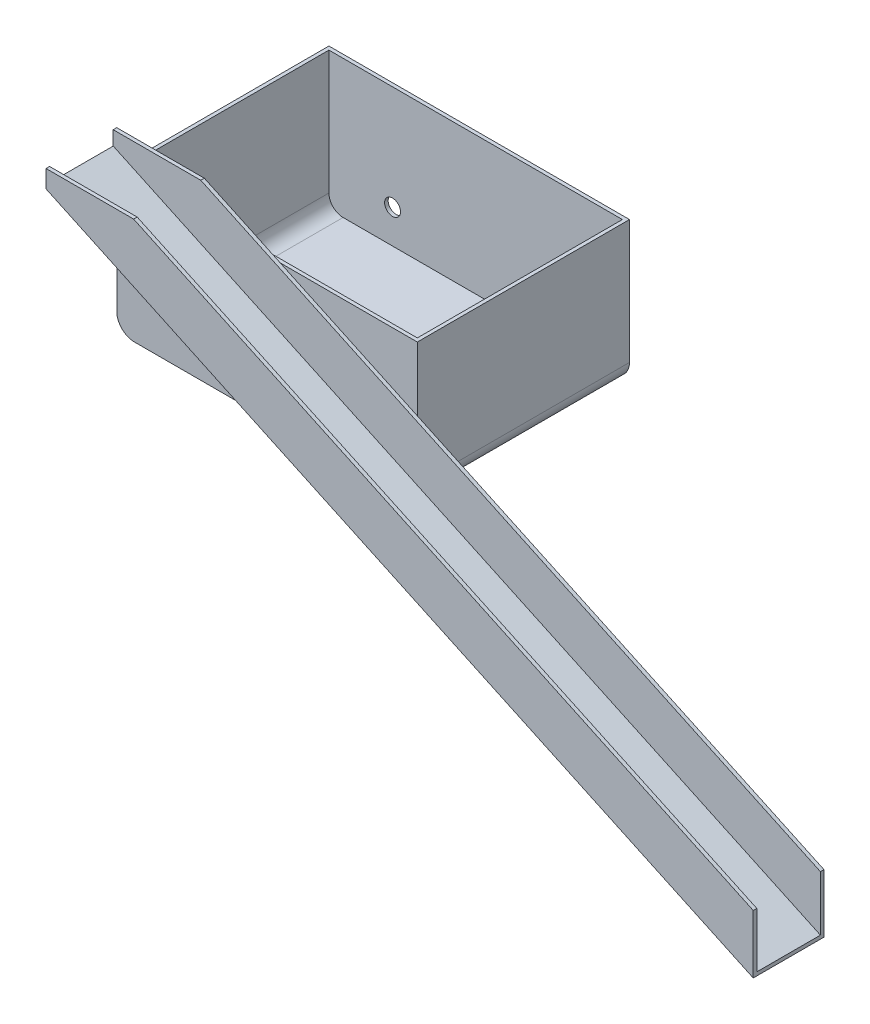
ISO-10303-21;
HEADER;
FILE_DESCRIPTION(('STEP AP214'),'2;1');
FILE_NAME('part.step','',(''),(''),'','','');
FILE_SCHEMA(('AUTOMOTIVE_DESIGN { 1 0 10303 214 1 1 1 1 }'));
ENDSEC;
DATA;
#1=APPLICATION_CONTEXT('core data for automotive mechanical design processes');
#2=APPLICATION_PROTOCOL_DEFINITION('international standard','automotive_design',2000,#1);
#3=PRODUCT_CONTEXT('',#1,'mechanical');
#4=PRODUCT('Part','Part','',(#3));
#5=PRODUCT_RELATED_PRODUCT_CATEGORY('part','',(#4));
#6=PRODUCT_DEFINITION_FORMATION('','',#4);
#7=PRODUCT_DEFINITION_CONTEXT('part definition',#1,'design');
#8=PRODUCT_DEFINITION('design','',#6,#7);
#9=PRODUCT_DEFINITION_SHAPE('','',#8);
#10=(LENGTH_UNIT() NAMED_UNIT(*) SI_UNIT(.MILLI.,.METRE.));
#11=(NAMED_UNIT(*) PLANE_ANGLE_UNIT() SI_UNIT($,.RADIAN.));
#12=(NAMED_UNIT(*) SI_UNIT($,.STERADIAN.) SOLID_ANGLE_UNIT());
#13=UNCERTAINTY_MEASURE_WITH_UNIT(LENGTH_MEASURE(1.E-05),#10,'distance_accuracy_value','');
#14=(GEOMETRIC_REPRESENTATION_CONTEXT(3) GLOBAL_UNCERTAINTY_ASSIGNED_CONTEXT((#13)) GLOBAL_UNIT_ASSIGNED_CONTEXT((#10,
#11,#12)) REPRESENTATION_CONTEXT('',''));
#15=CARTESIAN_POINT('',(0.,0.,0.));
#16=DIRECTION('',(0.,0.,1.));
#17=DIRECTION('',(1.,0.,0.));
#18=AXIS2_PLACEMENT_3D('',#15,#16,#17);
#19=CARTESIAN_POINT('',(24.7704891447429,98.2615316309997,80.));
#20=DIRECTION('',(-0.422618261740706,-0.906307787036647,0.));
#21=DIRECTION('',(0.906307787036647,-0.422618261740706,0.));
#22=AXIS2_PLACEMENT_3D('',#19,#20,#21);
#23=PLANE('',#22);
#24=DIRECTION('',(0.,0.,-1.));
#25=VECTOR('',#24,1.);
#26=CARTESIAN_POINT('',(200.,16.5506687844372,80.));
#27=LINE('',#26,#25);
#28=CARTESIAN_POINT('',(200.,16.5506687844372,80.));
#29=VERTEX_POINT('',#28);
#30=CARTESIAN_POINT('',(200.,16.5506687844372,79.));
#31=VERTEX_POINT('',#30);
#32=EDGE_CURVE('E267',#29,#31,#27,.T.);
#33=ORIENTED_EDGE('',*,*,#32,.T.);
#34=DIRECTION('',(-0.906307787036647,0.422618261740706,0.));
#35=VECTOR('',#34,1.);
#36=CARTESIAN_POINT('',(24.7704891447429,98.2615316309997,79.));
#37=LINE('',#36,#35);
#38=CARTESIAN_POINT('',(24.7704891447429,98.2615316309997,79.));
#39=VERTEX_POINT('',#38);
#40=EDGE_CURVE('E199',#31,#39,#37,.T.);
#41=ORIENTED_EDGE('',*,*,#40,.T.);
#42=DIRECTION('',(0.,0.,-1.));
#43=VECTOR('',#42,1.);
#44=CARTESIAN_POINT('',(24.7704891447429,98.2615316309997,80.));
#45=LINE('',#44,#43);
#46=CARTESIAN_POINT('',(24.7704891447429,98.2615316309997,80.));
#47=VERTEX_POINT('',#46);
#48=EDGE_CURVE('E263',#47,#39,#45,.T.);
#49=ORIENTED_EDGE('',*,*,#48,.F.);
#50=DIRECTION('',(-0.906307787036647,0.422618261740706,0.));
#51=VECTOR('',#50,1.);
#52=CARTESIAN_POINT('',(24.7704891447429,98.2615316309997,80.));
#53=LINE('',#52,#51);
#54=EDGE_CURVE('E238',#29,#47,#53,.T.);
#55=ORIENTED_EDGE('',*,*,#54,.F.);
#56=EDGE_LOOP('',(#33,#41,#49,#55));
#57=FACE_BOUND('',#56,.T.);
#58=ADVANCED_FACE('F32',(#57),#23,.F.);
#59=CARTESIAN_POINT('',(0.,98.2615316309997,80.));
#60=DIRECTION('',(0.,-1.,0.));
#61=DIRECTION('',(0.,0.,-1.));
#62=AXIS2_PLACEMENT_3D('',#59,#60,#61);
#63=PLANE('',#62);
#64=ORIENTED_EDGE('',*,*,#48,.T.);
#65=DIRECTION('',(-1.,0.,0.));
#66=VECTOR('',#65,1.);
#67=CARTESIAN_POINT('',(0.,98.2615316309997,79.));
#68=LINE('',#67,#66);
#69=CARTESIAN_POINT('',(0.,98.2615316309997,79.));
#70=VERTEX_POINT('',#69);
#71=EDGE_CURVE('E11',#39,#70,#68,.T.);
#72=ORIENTED_EDGE('',*,*,#71,.T.);
#73=DIRECTION('',(0.,0.,-1.));
#74=VECTOR('',#73,1.);
#75=CARTESIAN_POINT('',(0.,98.2615316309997,80.));
#76=LINE('',#75,#74);
#77=CARTESIAN_POINT('',(0.,98.2615316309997,80.));
#78=VERTEX_POINT('',#77);
#79=EDGE_CURVE('E259',#78,#70,#76,.T.);
#80=ORIENTED_EDGE('',*,*,#79,.F.);
#81=DIRECTION('',(-1.,0.,0.));
#82=VECTOR('',#81,1.);
#83=CARTESIAN_POINT('',(0.,98.2615316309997,80.));
#84=LINE('',#83,#82);
#85=EDGE_CURVE('E240',#47,#78,#84,.T.);
#86=ORIENTED_EDGE('',*,*,#85,.F.);
#87=EDGE_LOOP('',(#64,#72,#80,#86));
#88=FACE_BOUND('',#87,.T.);
#89=ADVANCED_FACE('F446',(#88),#63,.F.);
#90=CARTESIAN_POINT('',(85.,48.2615316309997,60.));
#91=DIRECTION('',(0.,0.,-1.));
#92=DIRECTION('',(-1.,0.,0.));
#93=AXIS2_PLACEMENT_3D('',#90,#91,#92);
#94=PLANE('',#93);
#95=DIRECTION('',(-0.906307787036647,0.422618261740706,0.));
#96=VECTOR('',#95,1.);
#97=CARTESIAN_POINT('',(24.7704891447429,98.2615316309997,60.));
#98=LINE('',#97,#96);
#99=CARTESIAN_POINT('',(85.,70.1760494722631,60.));
#100=VERTEX_POINT('',#99);
#101=CARTESIAN_POINT('',(46.215558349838,88.2615316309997,60.));
#102=VERTEX_POINT('',#101);
#103=EDGE_CURVE('E256',#100,#102,#98,.T.);
#104=ORIENTED_EDGE('',*,*,#103,.F.);
#105=DIRECTION('',(0.,1.,0.));
#106=VECTOR('',#105,1.);
#107=CARTESIAN_POINT('',(85.,53.6253806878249,60.));
#108=LINE('',#107,#106);
#109=CARTESIAN_POINT('',(85.,88.2615316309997,60.));
#110=VERTEX_POINT('',#109);
#111=EDGE_CURVE('E326',#100,#110,#108,.T.);
#112=ORIENTED_EDGE('',*,*,#111,.T.);
#113=DIRECTION('',(-1.,0.,0.));
#114=VECTOR('',#113,1.);
#115=CARTESIAN_POINT('',(0.,88.2615316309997,60.));
#116=LINE('',#115,#114);
#117=EDGE_CURVE('E332',#110,#102,#116,.T.);
#118=ORIENTED_EDGE('',*,*,#117,.T.);
#119=EDGE_LOOP('',(#104,#112,#118));
#120=FACE_BOUND('',#119,.T.);
#121=ADVANCED_FACE('F452',(#120),#94,.F.);
#122=DIRECTION('',(0.90630778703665,-0.422618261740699,0.));
#123=VECTOR('',#122,1.);
#124=CARTESIAN_POINT('',(0.,93.2615316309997,60.));
#125=LINE('',#124,#123);
#126=CARTESIAN_POINT('',(10.7225346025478,88.2615316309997,60.));
#127=VERTEX_POINT('',#126);
#128=CARTESIAN_POINT('',(85.,53.6253806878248,60.));
#129=VERTEX_POINT('',#128);
#130=EDGE_CURVE('E55',#127,#129,#125,.T.);
#131=ORIENTED_EDGE('',*,*,#130,.F.);
#132=CARTESIAN_POINT('',(0.,88.2615316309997,60.));
#133=VERTEX_POINT('',#132);
#134=EDGE_CURVE('E330',#127,#133,#116,.T.);
#135=ORIENTED_EDGE('',*,*,#134,.T.);
#136=DIRECTION('',(0.,-1.,0.));
#137=VECTOR('',#136,1.);
#138=CARTESIAN_POINT('',(0.,88.2615316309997,60.));
#139=LINE('',#138,#137);
#140=CARTESIAN_POINT('',(0.,53.2615316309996,60.));
#141=VERTEX_POINT('',#140);
#142=EDGE_CURVE('E335',#133,#141,#139,.T.);
#143=ORIENTED_EDGE('',*,*,#142,.T.);
#144=CARTESIAN_POINT('',(5.,53.2615316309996,60.));
#145=DIRECTION('',(0.,0.,-1.));
#146=DIRECTION('',(-1.,0.,0.));
#147=AXIS2_PLACEMENT_3D('',#144,#145,#146);
#148=CIRCLE('',#147,5.);
#149=CARTESIAN_POINT('',(5.,48.2615316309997,60.));
#150=VERTEX_POINT('',#149);
#151=EDGE_CURVE('E366',#141,#150,#148,.F.);
#152=ORIENTED_EDGE('',*,*,#151,.T.);
#153=DIRECTION('',(1.,0.,0.));
#154=VECTOR('',#153,1.);
#155=CARTESIAN_POINT('',(0.,48.2615316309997,60.));
#156=LINE('',#155,#154);
#157=CARTESIAN_POINT('',(80.,48.2615316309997,60.));
#158=VERTEX_POINT('',#157);
#159=EDGE_CURVE('E323',#150,#158,#156,.T.);
#160=ORIENTED_EDGE('',*,*,#159,.T.);
#161=CARTESIAN_POINT('',(80.,53.2615316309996,60.));
#162=DIRECTION('',(0.,0.,-1.));
#163=DIRECTION('',(-1.,0.,0.));
#164=AXIS2_PLACEMENT_3D('',#161,#162,#163);
#165=CIRCLE('',#164,5.);
#166=CARTESIAN_POINT('',(85.,53.2615316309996,60.));
#167=VERTEX_POINT('',#166);
#168=EDGE_CURVE('E368',#158,#167,#165,.F.);
#169=ORIENTED_EDGE('',*,*,#168,.T.);
#170=EDGE_CURVE('E328',#167,#129,#108,.T.);
#171=ORIENTED_EDGE('',*,*,#170,.T.);
#172=EDGE_LOOP('',(#131,#135,#143,#152,#160,#169,#171));
#173=FACE_BOUND('',#172,.T.);
#174=ADVANCED_FACE('F544',(#173),#94,.F.);
#175=CARTESIAN_POINT('',(0.,88.2615316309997,60.));
#176=DIRECTION('',(0.,-1.,0.));
#177=DIRECTION('',(0.,0.,-1.));
#178=AXIS2_PLACEMENT_3D('',#175,#176,#177);
#179=PLANE('',#178);
#180=DIRECTION('',(-1.,0.,0.));
#181=VECTOR('',#180,1.);
#182=CARTESIAN_POINT('',(0.,88.2615316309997,0.));
#183=LINE('',#182,#181);
#184=CARTESIAN_POINT('',(85.,88.2615316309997,0.));
#185=VERTEX_POINT('',#184);
#186=CARTESIAN_POINT('',(0.,88.2615316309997,0.));
#187=VERTEX_POINT('',#186);
#188=EDGE_CURVE('E344',#185,#187,#183,.T.);
#189=ORIENTED_EDGE('',*,*,#188,.T.);
#190=DIRECTION('',(0.,0.,-1.));
#191=VECTOR('',#190,1.);
#192=CARTESIAN_POINT('',(0.,88.2615316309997,60.));
#193=LINE('',#192,#191);
#194=EDGE_CURVE('E339',#133,#187,#193,.T.);
#195=ORIENTED_EDGE('',*,*,#194,.F.);
#196=ORIENTED_EDGE('',*,*,#134,.F.);
#197=EDGE_CURVE('E336',#102,#127,#116,.T.);
#198=ORIENTED_EDGE('',*,*,#197,.F.);
#199=ORIENTED_EDGE('',*,*,#117,.F.);
#200=DIRECTION('',(0.,0.,-1.));
#201=VECTOR('',#200,1.);
#202=CARTESIAN_POINT('',(85.,88.2615316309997,60.));
#203=LINE('',#202,#201);
#204=EDGE_CURVE('E351',#110,#185,#203,.T.);
#205=ORIENTED_EDGE('',*,*,#204,.T.);
#206=EDGE_LOOP('',(#189,#195,#196,#198,#199,#205));
#207=FACE_BOUND('',#206,.T.);
#208=DIRECTION('',(-1.,0.,0.));
#209=VECTOR('',#208,1.);
#210=CARTESIAN_POINT('',(85.,88.2615316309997,1.));
#211=LINE('',#210,#209);
#212=CARTESIAN_POINT('',(84.,88.2615316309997,1.));
#213=VERTEX_POINT('',#212);
#214=CARTESIAN_POINT('',(1.,88.2615316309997,1.));
#215=VERTEX_POINT('',#214);
#216=EDGE_CURVE('E308',#213,#215,#211,.T.);
#217=ORIENTED_EDGE('',*,*,#216,.F.);
#218=DIRECTION('',(0.,0.,-1.));
#219=VECTOR('',#218,1.);
#220=CARTESIAN_POINT('',(84.,88.2615316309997,60.));
#221=LINE('',#220,#219);
#222=CARTESIAN_POINT('',(84.,88.2615316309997,59.));
#223=VERTEX_POINT('',#222);
#224=EDGE_CURVE('E306',#223,#213,#221,.T.);
#225=ORIENTED_EDGE('',*,*,#224,.F.);
#226=DIRECTION('',(-1.,0.,0.));
#227=VECTOR('',#226,1.);
#228=CARTESIAN_POINT('',(85.,88.2615316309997,59.));
#229=LINE('',#228,#227);
#230=CARTESIAN_POINT('',(1.,88.2615316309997,59.));
#231=VERTEX_POINT('',#230);
#232=EDGE_CURVE('E296',#223,#231,#229,.T.);
#233=ORIENTED_EDGE('',*,*,#232,.T.);
#234=DIRECTION('',(0.,0.,-1.));
#235=VECTOR('',#234,1.);
#236=CARTESIAN_POINT('',(1.,88.2615316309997,60.));
#237=LINE('',#236,#235);
#238=EDGE_CURVE('E300',#231,#215,#237,.T.);
#239=ORIENTED_EDGE('',*,*,#238,.T.);
#240=EDGE_LOOP('',(#217,#225,#233,#239));
#241=FACE_BOUND('',#240,.T.);
#242=ADVANCED_FACE('F421',(#207,#241),#179,.F.);
#243=CARTESIAN_POINT('',(85.,48.2615316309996,60.));
#244=DIRECTION('',(0.,1.,0.));
#245=DIRECTION('',(0.,0.,1.));
#246=AXIS2_PLACEMENT_3D('',#243,#244,#245);
#247=PLANE('',#246);
#248=DIRECTION('',(1.,0.,0.));
#249=VECTOR('',#248,1.);
#250=CARTESIAN_POINT('',(85.,48.2615316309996,0.));
#251=LINE('',#250,#249);
#252=CARTESIAN_POINT('',(5.,48.2615316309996,0.));
#253=VERTEX_POINT('',#252);
#254=CARTESIAN_POINT('',(80.,48.2615316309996,0.));
#255=VERTEX_POINT('',#254);
#256=EDGE_CURVE('E314',#253,#255,#251,.T.);
#257=ORIENTED_EDGE('',*,*,#256,.T.);
#258=DIRECTION('',(0.,0.,-1.));
#259=VECTOR('',#258,1.);
#260=CARTESIAN_POINT('',(80.,48.2615316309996,60.));
#261=LINE('',#260,#259);
#262=EDGE_CURVE('E364',#255,#158,#261,.F.);
#263=ORIENTED_EDGE('',*,*,#262,.T.);
#264=ORIENTED_EDGE('',*,*,#159,.F.);
#265=DIRECTION('',(0.,0.,-1.));
#266=VECTOR('',#265,1.);
#267=CARTESIAN_POINT('',(5.,48.2615316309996,60.));
#268=LINE('',#267,#266);
#269=EDGE_CURVE('E361',#150,#253,#268,.T.);
#270=ORIENTED_EDGE('',*,*,#269,.T.);
#271=EDGE_LOOP('',(#257,#263,#264,#270));
#272=FACE_BOUND('',#271,.T.);
#273=ADVANCED_FACE('F556',(#272),#247,.F.);
#274=CARTESIAN_POINT('',(85.,88.2615316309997,60.));
#275=DIRECTION('',(-1.,0.,0.));
#276=DIRECTION('',(0.,0.,1.));
#277=AXIS2_PLACEMENT_3D('',#274,#275,#276);
#278=PLANE('',#277);
#279=ORIENTED_EDGE('',*,*,#170,.F.);
#280=DIRECTION('',(0.,0.,-1.));
#281=VECTOR('',#280,1.);
#282=CARTESIAN_POINT('',(85.,53.2615316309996,60.));
#283=LINE('',#282,#281);
#284=CARTESIAN_POINT('',(85.,53.2615316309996,0.));
#285=VERTEX_POINT('',#284);
#286=EDGE_CURVE('E354',#167,#285,#283,.T.);
#287=ORIENTED_EDGE('',*,*,#286,.T.);
#288=DIRECTION('',(0.,1.,0.));
#289=VECTOR('',#288,1.);
#290=CARTESIAN_POINT('',(85.,88.2615316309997,0.));
#291=LINE('',#290,#289);
#292=EDGE_CURVE('E342',#285,#185,#291,.T.);
#293=ORIENTED_EDGE('',*,*,#292,.T.);
#294=ORIENTED_EDGE('',*,*,#204,.F.);
#295=ORIENTED_EDGE('',*,*,#111,.F.);
#296=EDGE_CURVE('E331',#129,#100,#108,.T.);
#297=ORIENTED_EDGE('',*,*,#296,.F.);
#298=EDGE_LOOP('',(#279,#287,#293,#294,#295,#297));
#299=FACE_BOUND('',#298,.T.);
#300=ADVANCED_FACE('F564',(#299),#278,.F.);
#301=CARTESIAN_POINT('',(0.,53.2615316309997,60.));
#302=DIRECTION('',(1.,0.,0.));
#303=DIRECTION('',(0.,0.,-1.));
#304=AXIS2_PLACEMENT_3D('',#301,#302,#303);
#305=PLANE('',#304);
#306=DIRECTION('',(0.,-1.,0.));
#307=VECTOR('',#306,1.);
#308=CARTESIAN_POINT('',(0.,53.2615316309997,0.));
#309=LINE('',#308,#307);
#310=CARTESIAN_POINT('',(0.,53.2615316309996,0.));
#311=VERTEX_POINT('',#310);
#312=EDGE_CURVE('E327',#187,#311,#309,.T.);
#313=ORIENTED_EDGE('',*,*,#312,.T.);
#314=DIRECTION('',(0.,0.,-1.));
#315=VECTOR('',#314,1.);
#316=CARTESIAN_POINT('',(0.,53.2615316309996,60.));
#317=LINE('',#316,#315);
#318=EDGE_CURVE('E370',#311,#141,#317,.F.);
#319=ORIENTED_EDGE('',*,*,#318,.T.);
#320=ORIENTED_EDGE('',*,*,#142,.F.);
#321=ORIENTED_EDGE('',*,*,#194,.T.);
#322=EDGE_LOOP('',(#313,#319,#320,#321));
#323=FACE_BOUND('',#322,.T.);
#324=ADVANCED_FACE('F549',(#323),#305,.F.);
#325=CARTESIAN_POINT('',(85.,48.2615316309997,0.));
#326=DIRECTION('',(0.,0.,-1.));
#327=DIRECTION('',(-1.,0.,0.));
#328=AXIS2_PLACEMENT_3D('',#325,#326,#327);
#329=PLANE('',#328);
#330=CARTESIAN_POINT('',(66.,58.7615316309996,0.));
#331=DIRECTION('',(0.,0.,-1.));
#332=DIRECTION('',(-1.,0.,0.));
#333=AXIS2_PLACEMENT_3D('',#330,#331,#332);
#334=CIRCLE('',#333,2.25);
#335=CARTESIAN_POINT('',(63.75,58.7615316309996,0.));
#336=VERTEX_POINT('',#335);
#337=EDGE_CURVE('E396',#336,#336,#334,.T.);
#338=ORIENTED_EDGE('',*,*,#337,.F.);
#339=EDGE_LOOP('',(#338));
#340=FACE_BOUND('',#339,.T.);
#341=CARTESIAN_POINT('',(19.,58.7615316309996,0.));
#342=DIRECTION('',(0.,0.,-1.));
#343=DIRECTION('',(-1.,0.,0.));
#344=AXIS2_PLACEMENT_3D('',#341,#342,#343);
#345=CIRCLE('',#344,2.25);
#346=CARTESIAN_POINT('',(16.75,58.7615316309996,0.));
#347=VERTEX_POINT('',#346);
#348=EDGE_CURVE('E205',#347,#347,#345,.T.);
#349=ORIENTED_EDGE('',*,*,#348,.F.);
#350=EDGE_LOOP('',(#349));
#351=FACE_BOUND('',#350,.T.);
#352=ORIENTED_EDGE('',*,*,#292,.F.);
#353=CARTESIAN_POINT('',(80.,53.2615316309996,0.));
#354=DIRECTION('',(0.,0.,-1.));
#355=DIRECTION('',(-1.,0.,0.));
#356=AXIS2_PLACEMENT_3D('',#353,#354,#355);
#357=CIRCLE('',#356,5.);
#358=EDGE_CURVE('E359',#285,#255,#357,.T.);
#359=ORIENTED_EDGE('',*,*,#358,.T.);
#360=ORIENTED_EDGE('',*,*,#256,.F.);
#361=CARTESIAN_POINT('',(5.,53.2615316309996,0.));
#362=DIRECTION('',(0.,0.,-1.));
#363=DIRECTION('',(-1.,0.,0.));
#364=AXIS2_PLACEMENT_3D('',#361,#362,#363);
#365=CIRCLE('',#364,5.);
#366=EDGE_CURVE('E357',#253,#311,#365,.T.);
#367=ORIENTED_EDGE('',*,*,#366,.T.);
#368=ORIENTED_EDGE('',*,*,#312,.F.);
#369=ORIENTED_EDGE('',*,*,#188,.F.);
#370=EDGE_LOOP('',(#352,#359,#360,#367,#368,#369));
#371=FACE_BOUND('',#370,.T.);
#372=ADVANCED_FACE('F493',(#340,#351,#371),#329,.T.);
#373=CARTESIAN_POINT('',(80.,53.2615316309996,60.));
#374=DIRECTION('',(0.,0.,-1.));
#375=DIRECTION('',(-1.,0.,0.));
#376=AXIS2_PLACEMENT_3D('',#373,#374,#375);
#377=CYLINDRICAL_SURFACE('',#376,5.);
#378=ORIENTED_EDGE('',*,*,#168,.F.);
#379=ORIENTED_EDGE('',*,*,#262,.F.);
#380=ORIENTED_EDGE('',*,*,#358,.F.);
#381=ORIENTED_EDGE('',*,*,#286,.F.);
#382=EDGE_LOOP('',(#378,#379,#380,#381));
#383=FACE_BOUND('',#382,.T.);
#384=ADVANCED_FACE('F560',(#383),#377,.T.);
#385=CARTESIAN_POINT('',(5.,53.2615316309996,60.));
#386=DIRECTION('',(0.,0.,-1.));
#387=DIRECTION('',(-1.,0.,0.));
#388=AXIS2_PLACEMENT_3D('',#385,#386,#387);
#389=CYLINDRICAL_SURFACE('',#388,5.);
#390=ORIENTED_EDGE('',*,*,#151,.F.);
#391=ORIENTED_EDGE('',*,*,#318,.F.);
#392=ORIENTED_EDGE('',*,*,#366,.F.);
#393=ORIENTED_EDGE('',*,*,#269,.F.);
#394=EDGE_LOOP('',(#390,#391,#392,#393));
#395=FACE_BOUND('',#394,.T.);
#396=ADVANCED_FACE('F34',(#395),#389,.T.);
#397=CARTESIAN_POINT('',(85.,49.2615316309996,60.));
#398=DIRECTION('',(0.,1.,0.));
#399=DIRECTION('',(0.,0.,1.));
#400=AXIS2_PLACEMENT_3D('',#397,#398,#399);
#401=PLANE('',#400);
#402=DIRECTION('',(1.,0.,0.));
#403=VECTOR('',#402,1.);
#404=CARTESIAN_POINT('',(85.,49.2615316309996,1.));
#405=LINE('',#404,#403);
#406=CARTESIAN_POINT('',(5.,49.2615316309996,1.));
#407=VERTEX_POINT('',#406);
#408=CARTESIAN_POINT('',(80.,49.2615316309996,1.));
#409=VERTEX_POINT('',#408);
#410=EDGE_CURVE('E275',#407,#409,#405,.T.);
#411=ORIENTED_EDGE('',*,*,#410,.F.);
#412=DIRECTION('',(0.,0.,1.));
#413=VECTOR('',#412,1.);
#414=CARTESIAN_POINT('',(5.,49.2615316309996,60.));
#415=LINE('',#414,#413);
#416=CARTESIAN_POINT('',(5.,49.2615316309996,59.));
#417=VERTEX_POINT('',#416);
#418=EDGE_CURVE('E282',#417,#407,#415,.F.);
#419=ORIENTED_EDGE('',*,*,#418,.F.);
#420=DIRECTION('',(1.,0.,0.));
#421=VECTOR('',#420,1.);
#422=CARTESIAN_POINT('',(85.,49.2615316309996,59.));
#423=LINE('',#422,#421);
#424=CARTESIAN_POINT('',(80.,49.2615316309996,59.));
#425=VERTEX_POINT('',#424);
#426=EDGE_CURVE('E283',#417,#425,#423,.T.);
#427=ORIENTED_EDGE('',*,*,#426,.T.);
#428=DIRECTION('',(0.,0.,1.));
#429=VECTOR('',#428,1.);
#430=CARTESIAN_POINT('',(80.,49.2615316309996,60.));
#431=LINE('',#430,#429);
#432=EDGE_CURVE('E279',#409,#425,#431,.T.);
#433=ORIENTED_EDGE('',*,*,#432,.F.);
#434=EDGE_LOOP('',(#411,#419,#427,#433));
#435=FACE_BOUND('',#434,.T.);
#436=ADVANCED_FACE('F436',(#435),#401,.T.);
#437=CARTESIAN_POINT('',(84.,88.2615316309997,60.));
#438=DIRECTION('',(-1.,0.,0.));
#439=DIRECTION('',(0.,0.,1.));
#440=AXIS2_PLACEMENT_3D('',#437,#438,#439);
#441=PLANE('',#440);
#442=DIRECTION('',(0.,1.,0.));
#443=VECTOR('',#442,1.);
#444=CARTESIAN_POINT('',(84.,48.2615316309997,59.));
#445=LINE('',#444,#443);
#446=CARTESIAN_POINT('',(84.,53.2615316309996,59.));
#447=VERTEX_POINT('',#446);
#448=EDGE_CURVE('E286',#447,#223,#445,.T.);
#449=ORIENTED_EDGE('',*,*,#448,.T.);
#450=ORIENTED_EDGE('',*,*,#224,.T.);
#451=DIRECTION('',(0.,1.,0.));
#452=VECTOR('',#451,1.);
#453=CARTESIAN_POINT('',(84.,48.2615316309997,1.));
#454=LINE('',#453,#452);
#455=CARTESIAN_POINT('',(84.,53.2615316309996,1.));
#456=VERTEX_POINT('',#455);
#457=EDGE_CURVE('E278',#456,#213,#454,.T.);
#458=ORIENTED_EDGE('',*,*,#457,.F.);
#459=DIRECTION('',(0.,0.,1.));
#460=VECTOR('',#459,1.);
#461=CARTESIAN_POINT('',(84.,53.2615316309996,60.));
#462=LINE('',#461,#460);
#463=EDGE_CURVE('E302',#447,#456,#462,.F.);
#464=ORIENTED_EDGE('',*,*,#463,.F.);
#465=EDGE_LOOP('',(#449,#450,#458,#464));
#466=FACE_BOUND('',#465,.T.);
#467=ADVANCED_FACE('F418',(#466),#441,.T.);
#468=CARTESIAN_POINT('',(1.,53.2615316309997,60.));
#469=DIRECTION('',(1.,0.,0.));
#470=DIRECTION('',(0.,0.,-1.));
#471=AXIS2_PLACEMENT_3D('',#468,#469,#470);
#472=PLANE('',#471);
#473=DIRECTION('',(0.,-1.,0.));
#474=VECTOR('',#473,1.);
#475=CARTESIAN_POINT('',(1.,48.2615316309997,1.));
#476=LINE('',#475,#474);
#477=CARTESIAN_POINT('',(1.,53.2615316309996,1.));
#478=VERTEX_POINT('',#477);
#479=EDGE_CURVE('E287',#215,#478,#476,.T.);
#480=ORIENTED_EDGE('',*,*,#479,.F.);
#481=ORIENTED_EDGE('',*,*,#238,.F.);
#482=DIRECTION('',(0.,-1.,0.));
#483=VECTOR('',#482,1.);
#484=CARTESIAN_POINT('',(1.,48.2615316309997,59.));
#485=LINE('',#484,#483);
#486=CARTESIAN_POINT('',(1.,53.2615316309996,59.));
#487=VERTEX_POINT('',#486);
#488=EDGE_CURVE('E297',#231,#487,#485,.T.);
#489=ORIENTED_EDGE('',*,*,#488,.T.);
#490=DIRECTION('',(0.,0.,-1.));
#491=VECTOR('',#490,1.);
#492=CARTESIAN_POINT('',(1.,53.2615316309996,60.));
#493=LINE('',#492,#491);
#494=EDGE_CURVE('E293',#478,#487,#493,.F.);
#495=ORIENTED_EDGE('',*,*,#494,.F.);
#496=EDGE_LOOP('',(#480,#481,#489,#495));
#497=FACE_BOUND('',#496,.T.);
#498=ADVANCED_FACE('F424',(#497),#472,.T.);
#499=CARTESIAN_POINT('',(85.,48.2615316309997,59.));
#500=DIRECTION('',(0.,0.,-1.));
#501=DIRECTION('',(-1.,0.,0.));
#502=AXIS2_PLACEMENT_3D('',#499,#500,#501);
#503=PLANE('',#502);
#504=ORIENTED_EDGE('',*,*,#426,.F.);
#505=CARTESIAN_POINT('',(5.,53.2615316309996,59.));
#506=DIRECTION('',(0.,0.,-1.));
#507=DIRECTION('',(-1.,0.,0.));
#508=AXIS2_PLACEMENT_3D('',#505,#506,#507);
#509=CIRCLE('',#508,4.);
#510=EDGE_CURVE('E281',#487,#417,#509,.F.);
#511=ORIENTED_EDGE('',*,*,#510,.F.);
#512=ORIENTED_EDGE('',*,*,#488,.F.);
#513=ORIENTED_EDGE('',*,*,#232,.F.);
#514=ORIENTED_EDGE('',*,*,#448,.F.);
#515=CARTESIAN_POINT('',(80.,53.2615316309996,59.));
#516=DIRECTION('',(0.,0.,-1.));
#517=DIRECTION('',(-1.,0.,0.));
#518=AXIS2_PLACEMENT_3D('',#515,#516,#517);
#519=CIRCLE('',#518,4.);
#520=EDGE_CURVE('E291',#425,#447,#519,.F.);
#521=ORIENTED_EDGE('',*,*,#520,.F.);
#522=EDGE_LOOP('',(#504,#511,#512,#513,#514,#521));
#523=FACE_BOUND('',#522,.T.);
#524=ADVANCED_FACE('F409',(#523),#503,.T.);
#525=CARTESIAN_POINT('',(85.,48.2615316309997,1.));
#526=DIRECTION('',(0.,0.,-1.));
#527=DIRECTION('',(-1.,0.,0.));
#528=AXIS2_PLACEMENT_3D('',#525,#526,#527);
#529=PLANE('',#528);
#530=CARTESIAN_POINT('',(66.,58.7615316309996,1.));
#531=DIRECTION('',(0.,0.,1.));
#532=DIRECTION('',(1.,0.,0.));
#533=AXIS2_PLACEMENT_3D('',#530,#531,#532);
#534=CIRCLE('',#533,2.25);
#535=CARTESIAN_POINT('',(68.25,58.7615316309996,1.));
#536=VERTEX_POINT('',#535);
#537=EDGE_CURVE('E399',#536,#536,#534,.T.);
#538=ORIENTED_EDGE('',*,*,#537,.F.);
#539=EDGE_LOOP('',(#538));
#540=FACE_BOUND('',#539,.T.);
#541=CARTESIAN_POINT('',(19.,58.7615316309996,1.));
#542=DIRECTION('',(0.,0.,1.));
#543=DIRECTION('',(1.,0.,0.));
#544=AXIS2_PLACEMENT_3D('',#541,#542,#543);
#545=CIRCLE('',#544,2.25);
#546=CARTESIAN_POINT('',(21.25,58.7615316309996,1.));
#547=VERTEX_POINT('',#546);
#548=EDGE_CURVE('E393',#547,#547,#545,.T.);
#549=ORIENTED_EDGE('',*,*,#548,.F.);
#550=EDGE_LOOP('',(#549));
#551=FACE_BOUND('',#550,.T.);
#552=ORIENTED_EDGE('',*,*,#457,.T.);
#553=ORIENTED_EDGE('',*,*,#216,.T.);
#554=ORIENTED_EDGE('',*,*,#479,.T.);
#555=CARTESIAN_POINT('',(5.,53.2615316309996,1.));
#556=DIRECTION('',(0.,0.,-1.));
#557=DIRECTION('',(-1.,0.,0.));
#558=AXIS2_PLACEMENT_3D('',#555,#556,#557);
#559=CIRCLE('',#558,4.);
#560=EDGE_CURVE('E305',#407,#478,#559,.T.);
#561=ORIENTED_EDGE('',*,*,#560,.F.);
#562=ORIENTED_EDGE('',*,*,#410,.T.);
#563=CARTESIAN_POINT('',(80.,53.2615316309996,1.));
#564=DIRECTION('',(0.,0.,-1.));
#565=DIRECTION('',(-1.,0.,0.));
#566=AXIS2_PLACEMENT_3D('',#563,#564,#565);
#567=CIRCLE('',#566,4.);
#568=EDGE_CURVE('E290',#456,#409,#567,.T.);
#569=ORIENTED_EDGE('',*,*,#568,.F.);
#570=EDGE_LOOP('',(#552,#553,#554,#561,#562,#569));
#571=FACE_BOUND('',#570,.T.);
#572=ADVANCED_FACE('F405',(#540,#551,#571),#529,.F.);
#573=CARTESIAN_POINT('',(80.,53.2615316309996,60.));
#574=DIRECTION('',(0.,0.,-1.));
#575=DIRECTION('',(-1.,0.,0.));
#576=AXIS2_PLACEMENT_3D('',#573,#574,#575);
#577=CYLINDRICAL_SURFACE('',#576,4.);
#578=ORIENTED_EDGE('',*,*,#520,.T.);
#579=ORIENTED_EDGE('',*,*,#463,.T.);
#580=ORIENTED_EDGE('',*,*,#568,.T.);
#581=ORIENTED_EDGE('',*,*,#432,.T.);
#582=EDGE_LOOP('',(#578,#579,#580,#581));
#583=FACE_BOUND('',#582,.T.);
#584=ADVANCED_FACE('F408',(#583),#577,.F.);
#585=CARTESIAN_POINT('',(5.,53.2615316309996,60.));
#586=DIRECTION('',(0.,0.,-1.));
#587=DIRECTION('',(-1.,0.,0.));
#588=AXIS2_PLACEMENT_3D('',#585,#586,#587);
#589=CYLINDRICAL_SURFACE('',#588,4.);
#590=ORIENTED_EDGE('',*,*,#510,.T.);
#591=ORIENTED_EDGE('',*,*,#418,.T.);
#592=ORIENTED_EDGE('',*,*,#560,.T.);
#593=ORIENTED_EDGE('',*,*,#494,.T.);
#594=EDGE_LOOP('',(#590,#591,#592,#593));
#595=FACE_BOUND('',#594,.T.);
#596=ADVANCED_FACE('F432',(#595),#589,.F.);
#597=CARTESIAN_POINT('',(0.,98.2615316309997,60.));
#598=DIRECTION('',(0.,0.,-1.));
#599=DIRECTION('',(-1.,0.,0.));
#600=AXIS2_PLACEMENT_3D('',#597,#598,#599);
#601=PLANE('',#600);
#602=CARTESIAN_POINT('',(200.,0.,60.));
#603=VERTEX_POINT('',#602);
#604=EDGE_CURVE('E245',#129,#603,#125,.T.);
#605=ORIENTED_EDGE('',*,*,#604,.F.);
#606=ORIENTED_EDGE('',*,*,#296,.T.);
#607=CARTESIAN_POINT('',(200.,16.5506687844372,60.));
#608=VERTEX_POINT('',#607);
#609=EDGE_CURVE('E253',#608,#100,#98,.T.);
#610=ORIENTED_EDGE('',*,*,#609,.F.);
#611=DIRECTION('',(0.,1.,0.));
#612=VECTOR('',#611,1.);
#613=CARTESIAN_POINT('',(200.,0.,60.));
#614=LINE('',#613,#612);
#615=EDGE_CURVE('E249',#603,#608,#614,.T.);
#616=ORIENTED_EDGE('',*,*,#615,.F.);
#617=EDGE_LOOP('',(#605,#606,#610,#616));
#618=FACE_BOUND('',#617,.T.);
#619=ADVANCED_FACE('F443',(#618),#601,.T.);
#620=CARTESIAN_POINT('',(0.,93.2615316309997,80.));
#621=DIRECTION('',(1.,0.,0.));
#622=DIRECTION('',(0.,0.,-1.));
#623=AXIS2_PLACEMENT_3D('',#620,#621,#622);
#624=PLANE('',#623);
#625=ORIENTED_EDGE('',*,*,#79,.T.);
#626=DIRECTION('',(0.,-1.,0.));
#627=VECTOR('',#626,1.);
#628=CARTESIAN_POINT('',(0.,131.078394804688,79.));
#629=LINE('',#628,#627);
#630=CARTESIAN_POINT('',(0.,94.2615316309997,79.));
#631=VERTEX_POINT('',#630);
#632=EDGE_CURVE('E223',#70,#631,#629,.T.);
#633=ORIENTED_EDGE('',*,*,#632,.T.);
#634=DIRECTION('',(0.,0.,-1.));
#635=VECTOR('',#634,1.);
#636=CARTESIAN_POINT('',(0.,94.2615316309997,79.));
#637=LINE('',#636,#635);
#638=CARTESIAN_POINT('',(0.,94.2615316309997,61.));
#639=VERTEX_POINT('',#638);
#640=EDGE_CURVE('E213',#631,#639,#637,.T.);
#641=ORIENTED_EDGE('',*,*,#640,.T.);
#642=DIRECTION('',(0.,1.,0.));
#643=VECTOR('',#642,1.);
#644=CARTESIAN_POINT('',(0.,131.078394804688,61.));
#645=LINE('',#644,#643);
#646=CARTESIAN_POINT('',(0.,98.2615316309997,61.));
#647=VERTEX_POINT('',#646);
#648=EDGE_CURVE('E227',#639,#647,#645,.T.);
#649=ORIENTED_EDGE('',*,*,#648,.T.);
#650=CARTESIAN_POINT('',(0.,98.2615316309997,60.));
#651=VERTEX_POINT('',#650);
#652=EDGE_CURVE('E242',#647,#651,#76,.T.);
#653=ORIENTED_EDGE('',*,*,#652,.T.);
#654=DIRECTION('',(0.,-1.,0.));
#655=VECTOR('',#654,1.);
#656=CARTESIAN_POINT('',(0.,93.2615316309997,60.));
#657=LINE('',#656,#655);
#658=CARTESIAN_POINT('',(0.,93.2615316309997,60.));
#659=VERTEX_POINT('',#658);
#660=EDGE_CURVE('E229',#651,#659,#657,.T.);
#661=ORIENTED_EDGE('',*,*,#660,.T.);
#662=DIRECTION('',(0.,0.,-1.));
#663=VECTOR('',#662,1.);
#664=CARTESIAN_POINT('',(0.,93.2615316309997,80.));
#665=LINE('',#664,#663);
#666=CARTESIAN_POINT('',(0.,93.2615316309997,80.));
#667=VERTEX_POINT('',#666);
#668=EDGE_CURVE('E272',#667,#659,#665,.T.);
#669=ORIENTED_EDGE('',*,*,#668,.F.);
#670=DIRECTION('',(0.,-1.,0.));
#671=VECTOR('',#670,1.);
#672=CARTESIAN_POINT('',(0.,93.2615316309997,80.));
#673=LINE('',#672,#671);
#674=EDGE_CURVE('E230',#78,#667,#673,.T.);
#675=ORIENTED_EDGE('',*,*,#674,.F.);
#676=EDGE_LOOP('',(#625,#633,#641,#649,#653,#661,#669,#675));
#677=FACE_BOUND('',#676,.T.);
#678=ADVANCED_FACE('F387',(#677),#624,.F.);
#679=CARTESIAN_POINT('',(0.,93.2615316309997,80.));
#680=DIRECTION('',(0.422618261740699,0.90630778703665,0.));
#681=DIRECTION('',(-0.90630778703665,0.422618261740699,0.));
#682=AXIS2_PLACEMENT_3D('',#679,#680,#681);
#683=PLANE('',#682);
#684=EDGE_CURVE('E246',#659,#127,#125,.T.);
#685=ORIENTED_EDGE('',*,*,#684,.T.);
#686=ORIENTED_EDGE('',*,*,#130,.T.);
#687=ORIENTED_EDGE('',*,*,#604,.T.);
#688=DIRECTION('',(0.,0.,-1.));
#689=VECTOR('',#688,1.);
#690=CARTESIAN_POINT('',(200.,0.,80.));
#691=LINE('',#690,#689);
#692=CARTESIAN_POINT('',(200.,0.,80.));
#693=VERTEX_POINT('',#692);
#694=EDGE_CURVE('E269',#693,#603,#691,.T.);
#695=ORIENTED_EDGE('',*,*,#694,.F.);
#696=DIRECTION('',(0.90630778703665,-0.422618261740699,0.));
#697=VECTOR('',#696,1.);
#698=CARTESIAN_POINT('',(0.,93.2615316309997,80.));
#699=LINE('',#698,#697);
#700=EDGE_CURVE('E233',#667,#693,#699,.T.);
#701=ORIENTED_EDGE('',*,*,#700,.F.);
#702=ORIENTED_EDGE('',*,*,#668,.T.);
#703=EDGE_LOOP('',(#685,#686,#687,#695,#701,#702));
#704=FACE_BOUND('',#703,.T.);
#705=ADVANCED_FACE('F462',(#704),#683,.F.);
#706=CARTESIAN_POINT('',(200.,0.,80.));
#707=DIRECTION('',(-1.,0.,0.));
#708=DIRECTION('',(0.,0.,1.));
#709=AXIS2_PLACEMENT_3D('',#706,#707,#708);
#710=PLANE('',#709);
#711=DIRECTION('',(0.,0.,-1.));
#712=VECTOR('',#711,1.);
#713=CARTESIAN_POINT('',(200.,1.,79.));
#714=LINE('',#713,#712);
#715=CARTESIAN_POINT('',(200.,1.,79.));
#716=VERTEX_POINT('',#715);
#717=CARTESIAN_POINT('',(200.,1.,61.));
#718=VERTEX_POINT('',#717);
#719=EDGE_CURVE('E204',#716,#718,#714,.T.);
#720=ORIENTED_EDGE('',*,*,#719,.F.);
#721=DIRECTION('',(0.,-1.,0.));
#722=VECTOR('',#721,1.);
#723=CARTESIAN_POINT('',(200.,25.1033471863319,79.));
#724=LINE('',#723,#722);
#725=EDGE_CURVE('E193',#31,#716,#724,.T.);
#726=ORIENTED_EDGE('',*,*,#725,.F.);
#727=ORIENTED_EDGE('',*,*,#32,.F.);
#728=DIRECTION('',(0.,1.,0.));
#729=VECTOR('',#728,1.);
#730=CARTESIAN_POINT('',(200.,0.,80.));
#731=LINE('',#730,#729);
#732=EDGE_CURVE('E236',#693,#29,#731,.T.);
#733=ORIENTED_EDGE('',*,*,#732,.F.);
#734=ORIENTED_EDGE('',*,*,#694,.T.);
#735=ORIENTED_EDGE('',*,*,#615,.T.);
#736=CARTESIAN_POINT('',(200.,16.5506687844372,61.));
#737=VERTEX_POINT('',#736);
#738=EDGE_CURVE('E266',#737,#608,#27,.T.);
#739=ORIENTED_EDGE('',*,*,#738,.F.);
#740=DIRECTION('',(0.,1.,0.));
#741=VECTOR('',#740,1.);
#742=CARTESIAN_POINT('',(200.,25.1033471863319,61.));
#743=LINE('',#742,#741);
#744=EDGE_CURVE('E215',#718,#737,#743,.T.);
#745=ORIENTED_EDGE('',*,*,#744,.F.);
#746=EDGE_LOOP('',(#720,#726,#727,#733,#734,#735,#739,#745));
#747=FACE_BOUND('',#746,.T.);
#748=ADVANCED_FACE('F217',(#747),#710,.F.);
#749=CARTESIAN_POINT('',(24.7704891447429,98.2615316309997,61.));
#750=VERTEX_POINT('',#749);
#751=CARTESIAN_POINT('',(24.7704891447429,98.2615316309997,60.));
#752=VERTEX_POINT('',#751);
#753=EDGE_CURVE('E262',#750,#752,#45,.T.);
#754=ORIENTED_EDGE('',*,*,#753,.F.);
#755=DIRECTION('',(0.906307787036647,-0.422618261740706,0.));
#756=VECTOR('',#755,1.);
#757=CARTESIAN_POINT('',(24.7704891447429,98.2615316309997,61.));
#758=LINE('',#757,#756);
#759=EDGE_CURVE('E47',#750,#737,#758,.T.);
#760=ORIENTED_EDGE('',*,*,#759,.T.);
#761=ORIENTED_EDGE('',*,*,#738,.T.);
#762=ORIENTED_EDGE('',*,*,#609,.T.);
#763=ORIENTED_EDGE('',*,*,#103,.T.);
#764=EDGE_CURVE('E252',#102,#752,#98,.T.);
#765=ORIENTED_EDGE('',*,*,#764,.T.);
#766=EDGE_LOOP('',(#754,#760,#761,#762,#763,#765));
#767=FACE_BOUND('',#766,.T.);
#768=ADVANCED_FACE('F379',(#767),#23,.F.);
#769=ORIENTED_EDGE('',*,*,#652,.F.);
#770=DIRECTION('',(1.,0.,0.));
#771=VECTOR('',#770,1.);
#772=CARTESIAN_POINT('',(0.,98.2615316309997,61.));
#773=LINE('',#772,#771);
#774=EDGE_CURVE('E40',#647,#750,#773,.T.);
#775=ORIENTED_EDGE('',*,*,#774,.T.);
#776=ORIENTED_EDGE('',*,*,#753,.T.);
#777=DIRECTION('',(-1.,0.,0.));
#778=VECTOR('',#777,1.);
#779=CARTESIAN_POINT('',(0.,98.2615316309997,60.));
#780=LINE('',#779,#778);
#781=EDGE_CURVE('E234',#752,#651,#780,.T.);
#782=ORIENTED_EDGE('',*,*,#781,.T.);
#783=EDGE_LOOP('',(#769,#775,#776,#782));
#784=FACE_BOUND('',#783,.T.);
#785=ADVANCED_FACE('F384',(#784),#63,.F.);
#786=CARTESIAN_POINT('',(0.,98.2615316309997,80.));
#787=DIRECTION('',(0.,0.,-1.));
#788=DIRECTION('',(-1.,0.,0.));
#789=AXIS2_PLACEMENT_3D('',#786,#787,#788);
#790=PLANE('',#789);
#791=ORIENTED_EDGE('',*,*,#674,.T.);
#792=ORIENTED_EDGE('',*,*,#700,.T.);
#793=ORIENTED_EDGE('',*,*,#732,.T.);
#794=ORIENTED_EDGE('',*,*,#54,.T.);
#795=ORIENTED_EDGE('',*,*,#85,.T.);
#796=EDGE_LOOP('',(#791,#792,#793,#794,#795));
#797=FACE_BOUND('',#796,.T.);
#798=ADVANCED_FACE('F461',(#797),#790,.F.);
#799=ORIENTED_EDGE('',*,*,#764,.F.);
#800=ORIENTED_EDGE('',*,*,#197,.T.);
#801=ORIENTED_EDGE('',*,*,#684,.F.);
#802=ORIENTED_EDGE('',*,*,#660,.F.);
#803=ORIENTED_EDGE('',*,*,#781,.F.);
#804=EDGE_LOOP('',(#799,#800,#801,#802,#803));
#805=FACE_BOUND('',#804,.T.);
#806=ADVANCED_FACE('F383',(#805),#601,.T.);
#807=CARTESIAN_POINT('',(-27.2642230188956,131.078394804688,79.));
#808=DIRECTION('',(0.,0.,1.));
#809=DIRECTION('',(1.,0.,0.));
#810=AXIS2_PLACEMENT_3D('',#807,#808,#809);
#811=PLANE('',#810);
#812=ORIENTED_EDGE('',*,*,#725,.T.);
#813=DIRECTION('',(0.90630778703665,-0.422618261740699,0.));
#814=VECTOR('',#813,1.);
#815=CARTESIAN_POINT('',(-27.2642230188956,106.975047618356,79.));
#816=LINE('',#815,#814);
#817=EDGE_CURVE('E196',#631,#716,#816,.T.);
#818=ORIENTED_EDGE('',*,*,#817,.F.);
#819=ORIENTED_EDGE('',*,*,#632,.F.);
#820=ORIENTED_EDGE('',*,*,#71,.F.);
#821=ORIENTED_EDGE('',*,*,#40,.F.);
#822=EDGE_LOOP('',(#812,#818,#819,#820,#821));
#823=FACE_BOUND('',#822,.T.);
#824=ADVANCED_FACE('F195',(#823),#811,.F.);
#825=CARTESIAN_POINT('',(-27.2642230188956,131.078394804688,61.));
#826=DIRECTION('',(0.,0.,-1.));
#827=DIRECTION('',(-1.,0.,0.));
#828=AXIS2_PLACEMENT_3D('',#825,#826,#827);
#829=PLANE('',#828);
#830=ORIENTED_EDGE('',*,*,#774,.F.);
#831=ORIENTED_EDGE('',*,*,#648,.F.);
#832=DIRECTION('',(0.90630778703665,-0.422618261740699,0.));
#833=VECTOR('',#832,1.);
#834=CARTESIAN_POINT('',(-27.2642230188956,106.975047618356,61.));
#835=LINE('',#834,#833);
#836=EDGE_CURVE('E214',#639,#718,#835,.T.);
#837=ORIENTED_EDGE('',*,*,#836,.T.);
#838=ORIENTED_EDGE('',*,*,#744,.T.);
#839=ORIENTED_EDGE('',*,*,#759,.F.);
#840=EDGE_LOOP('',(#830,#831,#837,#838,#839));
#841=FACE_BOUND('',#840,.T.);
#842=ADVANCED_FACE('F519',(#841),#829,.F.);
#843=CARTESIAN_POINT('',(-27.2642230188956,106.975047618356,79.));
#844=DIRECTION('',(-0.422618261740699,-0.90630778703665,0.));
#845=DIRECTION('',(0.90630778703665,-0.422618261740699,0.));
#846=AXIS2_PLACEMENT_3D('',#843,#844,#845);
#847=PLANE('',#846);
#848=ORIENTED_EDGE('',*,*,#817,.T.);
#849=ORIENTED_EDGE('',*,*,#719,.T.);
#850=ORIENTED_EDGE('',*,*,#836,.F.);
#851=ORIENTED_EDGE('',*,*,#640,.F.);
#852=EDGE_LOOP('',(#848,#849,#850,#851));
#853=FACE_BOUND('',#852,.T.);
#854=ADVANCED_FACE('F209',(#853),#847,.F.);
#855=CARTESIAN_POINT('',(19.,58.7615316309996,-19.));
#856=DIRECTION('',(0.,0.,1.));
#857=DIRECTION('',(1.,0.,0.));
#858=AXIS2_PLACEMENT_3D('',#855,#856,#857);
#859=CYLINDRICAL_SURFACE('',#858,2.25);
#860=ORIENTED_EDGE('',*,*,#348,.T.);
#861=EDGE_LOOP('',(#860));
#862=FACE_BOUND('',#861,.T.);
#863=ORIENTED_EDGE('',*,*,#548,.T.);
#864=EDGE_LOOP('',(#863));
#865=FACE_BOUND('',#864,.T.);
#866=ADVANCED_FACE('F498',(#862,#865),#859,.F.);
#867=CARTESIAN_POINT('',(66.,58.7615316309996,-19.));
#868=DIRECTION('',(0.,0.,1.));
#869=DIRECTION('',(1.,0.,0.));
#870=AXIS2_PLACEMENT_3D('',#867,#868,#869);
#871=CYLINDRICAL_SURFACE('',#870,2.25);
#872=ORIENTED_EDGE('',*,*,#337,.T.);
#873=EDGE_LOOP('',(#872));
#874=FACE_BOUND('',#873,.T.);
#875=ORIENTED_EDGE('',*,*,#537,.T.);
#876=EDGE_LOOP('',(#875));
#877=FACE_BOUND('',#876,.T.);
#878=ADVANCED_FACE('F403',(#874,#877),#871,.F.);
#879=CLOSED_SHELL('',(#58,#89,#121,#174,#242,#273,#300,#324,#372,#384,#396,#436,#467,#498,#524,
#572,#584,#596,#619,#678,#705,#748,#768,#785,#798,#806,#824,#842,#854,#866,#878));
#880=MANIFOLD_SOLID_BREP('B2',#879);
#881=ADVANCED_BREP_SHAPE_REPRESENTATION('',(#18,#880),#14);
#882=SHAPE_DEFINITION_REPRESENTATION(#9,#881);
ENDSEC;
END-ISO-10303-21;
